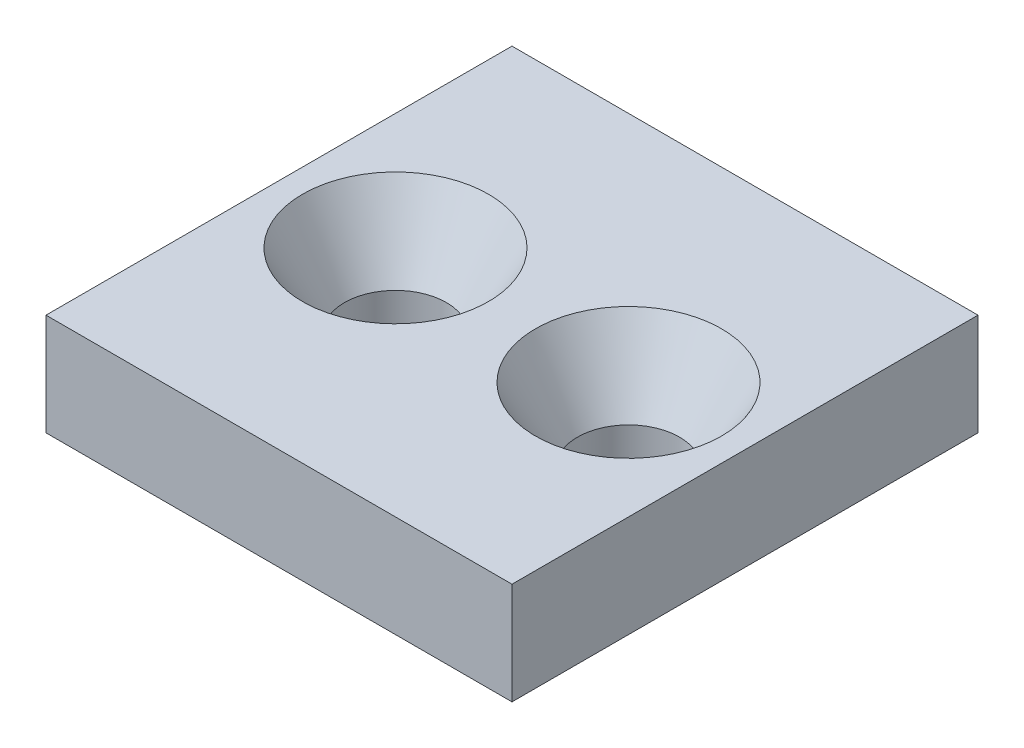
from build123d import *

# Parameters (mm, degrees)
SKETCH1_W      = 32
SKETCH1_H      = 32
EXTRUDE1_DEPTH = 7


with BuildPart() as part:
    # Sketch1 → Extrude1 (new body)
    with BuildSketch(Plane(origin=(0, 0, 0), x_dir=(1, 0, 0), z_dir=(0, 1, 0))):
        Rectangle(SKETCH1_W, SKETCH1_H)
    extrude(amount=EXTRUDE1_DEPTH)

    # Sketch2 → Cut-Revolve1 (revolve, cut)
    with BuildSketch(Plane.XY):
        Polygon((-14.386751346, 7), (-11.5, 2), (-11.5, 0), (-8, 0), (-8, 7), align=None)
    cut_revolve1 = revolve(axis=Axis((-8, 9.997099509, 0), (0, -1, 0)), mode=Mode.SUBTRACT)

    # Mirror1: Cut-Revolve1 across plane
    add(cut_revolve1.mirror(Plane(origin=(0, 0, 0), x_dir=(0, 0, 1), z_dir=(1, 0, 0))), mode=Mode.SUBTRACT)


solid = part.part
